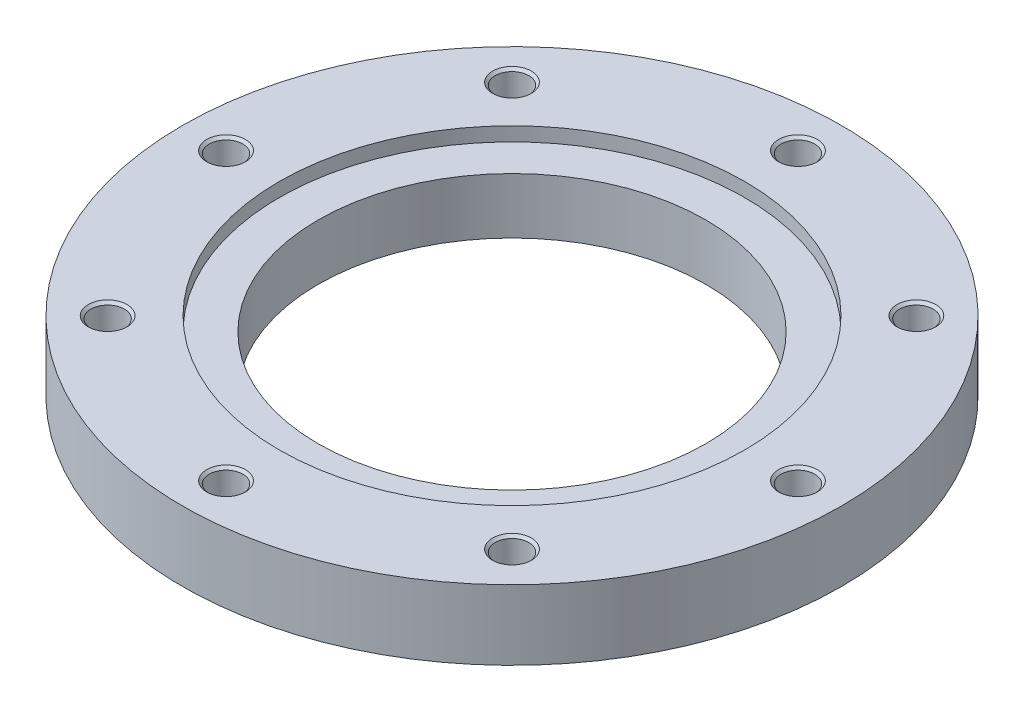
ISO-10303-21;
HEADER;
FILE_DESCRIPTION(('STEP AP214'),'2;1');
FILE_NAME('part.step','',(''),(''),'','','');
FILE_SCHEMA(('AUTOMOTIVE_DESIGN { 1 0 10303 214 1 1 1 1 }'));
ENDSEC;
DATA;
#1=APPLICATION_CONTEXT('core data for automotive mechanical design processes');
#2=APPLICATION_PROTOCOL_DEFINITION('international standard','automotive_design',2000,#1);
#3=PRODUCT_CONTEXT('',#1,'mechanical');
#4=PRODUCT('Part','Part','',(#3));
#5=PRODUCT_RELATED_PRODUCT_CATEGORY('part','',(#4));
#6=PRODUCT_DEFINITION_FORMATION('','',#4);
#7=PRODUCT_DEFINITION_CONTEXT('part definition',#1,'design');
#8=PRODUCT_DEFINITION('design','',#6,#7);
#9=PRODUCT_DEFINITION_SHAPE('','',#8);
#10=(LENGTH_UNIT() NAMED_UNIT(*) SI_UNIT(.MILLI.,.METRE.));
#11=(NAMED_UNIT(*) PLANE_ANGLE_UNIT() SI_UNIT($,.RADIAN.));
#12=(NAMED_UNIT(*) SI_UNIT($,.STERADIAN.) SOLID_ANGLE_UNIT());
#13=UNCERTAINTY_MEASURE_WITH_UNIT(LENGTH_MEASURE(1.E-05),#10,'distance_accuracy_value','');
#14=(GEOMETRIC_REPRESENTATION_CONTEXT(3) GLOBAL_UNCERTAINTY_ASSIGNED_CONTEXT((#13)) GLOBAL_UNIT_ASSIGNED_CONTEXT((#10,
#11,#12)) REPRESENTATION_CONTEXT('',''));
#15=CARTESIAN_POINT('',(0.,0.,0.));
#16=DIRECTION('',(0.,0.,1.));
#17=DIRECTION('',(1.,0.,0.));
#18=AXIS2_PLACEMENT_3D('',#15,#16,#17);
#19=CARTESIAN_POINT('',(0.,18.,0.));
#20=DIRECTION('',(0.,-1.,0.));
#21=DIRECTION('',(1.,0.,0.));
#22=AXIS2_PLACEMENT_3D('',#19,#20,#21);
#23=CYLINDRICAL_SURFACE('',#22,170.);
#24=CARTESIAN_POINT('',(0.,0.,0.));
#25=DIRECTION('',(0.,1.,0.));
#26=DIRECTION('',(1.,0.,0.));
#27=AXIS2_PLACEMENT_3D('',#24,#25,#26);
#28=CIRCLE('',#27,170.);
#29=CARTESIAN_POINT('',(170.,0.,0.));
#30=VERTEX_POINT('',#29);
#31=EDGE_CURVE('E9',#30,#30,#28,.T.);
#32=ORIENTED_EDGE('',*,*,#31,.T.);
#33=EDGE_LOOP('',(#32));
#34=FACE_BOUND('',#33,.T.);
#35=CARTESIAN_POINT('',(0.,36.,0.));
#36=DIRECTION('',(0.,1.,0.));
#37=DIRECTION('',(1.,0.,0.));
#38=AXIS2_PLACEMENT_3D('',#35,#36,#37);
#39=CIRCLE('',#38,170.);
#40=CARTESIAN_POINT('',(170.,36.,0.));
#41=VERTEX_POINT('',#40);
#42=EDGE_CURVE('E237',#41,#41,#39,.T.);
#43=ORIENTED_EDGE('',*,*,#42,.F.);
#44=EDGE_LOOP('',(#43));
#45=FACE_BOUND('',#44,.T.);
#46=ADVANCED_FACE('F15',(#34,#45),#23,.T.);
#47=CARTESIAN_POINT('',(135.,0.,0.));
#48=DIRECTION('',(0.,-1.,0.));
#49=DIRECTION('',(-1.,0.,0.));
#50=AXIS2_PLACEMENT_3D('',#47,#48,#49);
#51=PLANE('',#50);
#52=CARTESIAN_POINT('',(0.,0.,0.));
#53=DIRECTION('',(0.,1.,0.));
#54=DIRECTION('',(1.,0.,0.));
#55=AXIS2_PLACEMENT_3D('',#52,#53,#54);
#56=CIRCLE('',#55,100.);
#57=CARTESIAN_POINT('',(100.,0.,0.));
#58=VERTEX_POINT('',#57);
#59=EDGE_CURVE('E18',#58,#58,#56,.T.);
#60=ORIENTED_EDGE('',*,*,#59,.T.);
#61=EDGE_LOOP('',(#60));
#62=FACE_BOUND('',#61,.T.);
#63=ORIENTED_EDGE('',*,*,#31,.F.);
#64=EDGE_LOOP('',(#63));
#65=FACE_BOUND('',#64,.T.);
#66=ADVANCED_FACE('F305',(#62,#65),#51,.T.);
#67=CARTESIAN_POINT('',(0.,18.,0.));
#68=DIRECTION('',(0.,-1.,0.));
#69=DIRECTION('',(1.,0.,0.));
#70=AXIS2_PLACEMENT_3D('',#67,#68,#69);
#71=CYLINDRICAL_SURFACE('',#70,100.);
#72=ORIENTED_EDGE('',*,*,#59,.F.);
#73=EDGE_LOOP('',(#72));
#74=FACE_BOUND('',#73,.T.);
#75=CARTESIAN_POINT('',(0.,28.8,0.));
#76=DIRECTION('',(0.,1.,0.));
#77=DIRECTION('',(1.,0.,0.));
#78=AXIS2_PLACEMENT_3D('',#75,#76,#77);
#79=CIRCLE('',#78,100.);
#80=CARTESIAN_POINT('',(-100.,28.8,0.));
#81=VERTEX_POINT('',#80);
#82=EDGE_CURVE('E148',#81,#81,#79,.T.);
#83=ORIENTED_EDGE('',*,*,#82,.T.);
#84=EDGE_LOOP('',(#83));
#85=FACE_BOUND('',#84,.T.);
#86=ADVANCED_FACE('F309',(#74,#85),#71,.F.);
#87=CARTESIAN_POINT('',(135.,36.,0.));
#88=DIRECTION('',(0.,1.,0.));
#89=DIRECTION('',(1.,0.,0.));
#90=AXIS2_PLACEMENT_3D('',#87,#88,#89);
#91=PLANE('',#90);
#92=ORIENTED_EDGE('',*,*,#42,.T.);
#93=EDGE_LOOP('',(#92));
#94=FACE_BOUND('',#93,.T.);
#95=CARTESIAN_POINT('',(0.,36.,0.));
#96=DIRECTION('',(0.,-1.,0.));
#97=DIRECTION('',(1.,0.,0.));
#98=AXIS2_PLACEMENT_3D('',#95,#96,#97);
#99=CIRCLE('',#98,120.);
#100=CARTESIAN_POINT('',(-120.,36.,0.));
#101=VERTEX_POINT('',#100);
#102=EDGE_CURVE('E250',#101,#101,#99,.T.);
#103=ORIENTED_EDGE('',*,*,#102,.T.);
#104=EDGE_LOOP('',(#103));
#105=FACE_BOUND('',#104,.T.);
#106=CARTESIAN_POINT('',(147.5,36.,0.));
#107=DIRECTION('',(0.,-1.,0.));
#108=DIRECTION('',(1.,0.,0.));
#109=AXIS2_PLACEMENT_3D('',#106,#107,#108);
#110=CIRCLE('',#109,10.);
#111=CARTESIAN_POINT('',(157.5,36.,0.));
#112=VERTEX_POINT('',#111);
#113=EDGE_CURVE('E241',#112,#112,#110,.T.);
#114=ORIENTED_EDGE('',*,*,#113,.T.);
#115=EDGE_LOOP('',(#114));
#116=FACE_BOUND('',#115,.T.);
#117=CARTESIAN_POINT('',(104.298250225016,36.,-104.298250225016));
#118=DIRECTION('',(0.,-1.,0.));
#119=DIRECTION('',(0.707106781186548,0.,-0.707106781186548));
#120=AXIS2_PLACEMENT_3D('',#117,#118,#119);
#121=CIRCLE('',#120,10.);
#122=CARTESIAN_POINT('',(111.369318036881,36.,-111.369318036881));
#123=VERTEX_POINT('',#122);
#124=EDGE_CURVE('E271',#123,#123,#121,.T.);
#125=ORIENTED_EDGE('',*,*,#124,.T.);
#126=EDGE_LOOP('',(#125));
#127=FACE_BOUND('',#126,.T.);
#128=CARTESIAN_POINT('',(0.,36.,-147.5));
#129=DIRECTION('',(0.,-1.,0.));
#130=DIRECTION('',(0.,0.,-1.));
#131=AXIS2_PLACEMENT_3D('',#128,#129,#130);
#132=CIRCLE('',#131,10.);
#133=CARTESIAN_POINT('',(0.,36.,-157.5));
#134=VERTEX_POINT('',#133);
#135=EDGE_CURVE('E259',#134,#134,#132,.T.);
#136=ORIENTED_EDGE('',*,*,#135,.T.);
#137=EDGE_LOOP('',(#136));
#138=FACE_BOUND('',#137,.T.);
#139=CARTESIAN_POINT('',(-104.298250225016,36.,-104.298250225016));
#140=DIRECTION('',(0.,-1.,0.));
#141=DIRECTION('',(-0.707106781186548,0.,-0.707106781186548));
#142=AXIS2_PLACEMENT_3D('',#139,#140,#141);
#143=CIRCLE('',#142,10.);
#144=CARTESIAN_POINT('',(-111.369318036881,36.,-111.369318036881));
#145=VERTEX_POINT('',#144);
#146=EDGE_CURVE('E240',#145,#145,#143,.T.);
#147=ORIENTED_EDGE('',*,*,#146,.T.);
#148=EDGE_LOOP('',(#147));
#149=FACE_BOUND('',#148,.T.);
#150=CARTESIAN_POINT('',(-147.5,36.,0.));
#151=DIRECTION('',(0.,-1.,0.));
#152=DIRECTION('',(-1.,0.,0.));
#153=AXIS2_PLACEMENT_3D('',#150,#151,#152);
#154=CIRCLE('',#153,10.);
#155=CARTESIAN_POINT('',(-157.5,36.,0.));
#156=VERTEX_POINT('',#155);
#157=EDGE_CURVE('E217',#156,#156,#154,.T.);
#158=ORIENTED_EDGE('',*,*,#157,.T.);
#159=EDGE_LOOP('',(#158));
#160=FACE_BOUND('',#159,.T.);
#161=CARTESIAN_POINT('',(-104.298250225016,36.,104.298250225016));
#162=DIRECTION('',(0.,-1.,0.));
#163=DIRECTION('',(-0.707106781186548,0.,0.707106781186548));
#164=AXIS2_PLACEMENT_3D('',#161,#162,#163);
#165=CIRCLE('',#164,10.);
#166=CARTESIAN_POINT('',(-111.369318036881,36.,111.369318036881));
#167=VERTEX_POINT('',#166);
#168=EDGE_CURVE('E852',#167,#167,#165,.T.);
#169=ORIENTED_EDGE('',*,*,#168,.T.);
#170=EDGE_LOOP('',(#169));
#171=FACE_BOUND('',#170,.T.);
#172=CARTESIAN_POINT('',(0.,36.,147.5));
#173=DIRECTION('',(0.,-1.,0.));
#174=DIRECTION('',(0.,0.,1.));
#175=AXIS2_PLACEMENT_3D('',#172,#173,#174);
#176=CIRCLE('',#175,10.);
#177=CARTESIAN_POINT('',(0.,36.,157.5));
#178=VERTEX_POINT('',#177);
#179=EDGE_CURVE('E841',#178,#178,#176,.T.);
#180=ORIENTED_EDGE('',*,*,#179,.T.);
#181=EDGE_LOOP('',(#180));
#182=FACE_BOUND('',#181,.T.);
#183=CARTESIAN_POINT('',(104.298250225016,36.,104.298250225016));
#184=DIRECTION('',(0.,-1.,0.));
#185=DIRECTION('',(0.707106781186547,0.,0.707106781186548));
#186=AXIS2_PLACEMENT_3D('',#183,#184,#185);
#187=CIRCLE('',#186,10.);
#188=CARTESIAN_POINT('',(111.369318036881,36.,111.369318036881));
#189=VERTEX_POINT('',#188);
#190=EDGE_CURVE('E832',#189,#189,#187,.T.);
#191=ORIENTED_EDGE('',*,*,#190,.T.);
#192=EDGE_LOOP('',(#191));
#193=FACE_BOUND('',#192,.T.);
#194=ADVANCED_FACE('F286',(#94,#105,#116,#127,#138,#149,#160,#171,#182,#193),#91,.T.);
#195=CARTESIAN_POINT('',(0.,28.8,0.));
#196=DIRECTION('',(0.,-1.,0.));
#197=DIRECTION('',(-1.,0.,0.));
#198=AXIS2_PLACEMENT_3D('',#195,#196,#197);
#199=PLANE('',#198);
#200=CARTESIAN_POINT('',(0.,28.8,0.));
#201=DIRECTION('',(0.,-1.,0.));
#202=DIRECTION('',(1.,0.,0.));
#203=AXIS2_PLACEMENT_3D('',#200,#201,#202);
#204=CIRCLE('',#203,120.);
#205=CARTESIAN_POINT('',(120.,28.8,0.));
#206=VERTEX_POINT('',#205);
#207=EDGE_CURVE('E153',#206,#206,#204,.T.);
#208=ORIENTED_EDGE('',*,*,#207,.F.);
#209=EDGE_LOOP('',(#208));
#210=FACE_BOUND('',#209,.T.);
#211=ORIENTED_EDGE('',*,*,#82,.F.);
#212=EDGE_LOOP('',(#211));
#213=FACE_BOUND('',#212,.T.);
#214=ADVANCED_FACE('F292',(#210,#213),#199,.F.);
#215=CARTESIAN_POINT('',(0.,34.2,0.));
#216=DIRECTION('',(0.,-1.,0.));
#217=DIRECTION('',(1.,0.,0.));
#218=AXIS2_PLACEMENT_3D('',#215,#216,#217);
#219=CYLINDRICAL_SURFACE('',#218,120.);
#220=ORIENTED_EDGE('',*,*,#207,.T.);
#221=EDGE_LOOP('',(#220));
#222=FACE_BOUND('',#221,.T.);
#223=ORIENTED_EDGE('',*,*,#102,.F.);
#224=EDGE_LOOP('',(#223));
#225=FACE_BOUND('',#224,.T.);
#226=ADVANCED_FACE('F289',(#222,#225),#219,.F.);
#227=CARTESIAN_POINT('',(147.5,5.50386219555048,0.));
#228=DIRECTION('',(0.,1.,0.));
#229=DIRECTION('',(1.,0.,0.));
#230=AXIS2_PLACEMENT_3D('',#227,#228,#229);
#231=CONICAL_SURFACE('',#230,4.3234375,1.0471975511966);
#232=CARTESIAN_POINT('',(147.5,8.,0.));
#233=DIRECTION('',(0.,-1.,0.));
#234=DIRECTION('',(1.,0.,0.));
#235=AXIS2_PLACEMENT_3D('',#232,#233,#234);
#236=CIRCLE('',#235,8.646875);
#237=CARTESIAN_POINT('',(156.146875,8.,0.));
#238=VERTEX_POINT('',#237);
#239=EDGE_CURVE('E248',#238,#238,#236,.T.);
#240=ORIENTED_EDGE('',*,*,#239,.F.);
#241=EDGE_LOOP('',(#240));
#242=FACE_BOUND('',#241,.T.);
#243=CARTESIAN_POINT('',(147.5,3.00772439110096,0.));
#244=VERTEX_POINT('',#243);
#245=VERTEX_LOOP('',#244);
#246=FACE_BOUND('',#245,.T.);
#247=ADVANCED_FACE('F291',(#242,#246),#231,.F.);
#248=CARTESIAN_POINT('',(147.5,11.3234375,0.));
#249=DIRECTION('',(0.,1.,0.));
#250=DIRECTION('',(1.,0.,0.));
#251=AXIS2_PLACEMENT_3D('',#248,#249,#250);
#252=CYLINDRICAL_SURFACE('',#251,8.646875);
#253=CARTESIAN_POINT('',(147.5,14.646875,0.));
#254=DIRECTION('',(0.,-1.,0.));
#255=DIRECTION('',(1.,0.,0.));
#256=AXIS2_PLACEMENT_3D('',#253,#254,#255);
#257=CIRCLE('',#256,8.646875);
#258=CARTESIAN_POINT('',(156.146875,14.646875,0.));
#259=VERTEX_POINT('',#258);
#260=EDGE_CURVE('E251',#259,#259,#257,.T.);
#261=ORIENTED_EDGE('',*,*,#260,.F.);
#262=EDGE_LOOP('',(#261));
#263=FACE_BOUND('',#262,.T.);
#264=ORIENTED_EDGE('',*,*,#239,.T.);
#265=EDGE_LOOP('',(#264));
#266=FACE_BOUND('',#265,.T.);
#267=ADVANCED_FACE('F299',(#263,#266),#252,.F.);
#268=CARTESIAN_POINT('',(147.5,15.3234375,0.));
#269=DIRECTION('',(0.,1.,0.));
#270=DIRECTION('',(1.,0.,0.));
#271=AXIS2_PLACEMENT_3D('',#268,#269,#270);
#272=CONICAL_SURFACE('',#271,9.3234375,0.785398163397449);
#273=CARTESIAN_POINT('',(147.5,16.,0.));
#274=DIRECTION('',(0.,-1.,0.));
#275=DIRECTION('',(1.,0.,0.));
#276=AXIS2_PLACEMENT_3D('',#273,#274,#275);
#277=CIRCLE('',#276,10.);
#278=CARTESIAN_POINT('',(157.5,16.,0.));
#279=VERTEX_POINT('',#278);
#280=EDGE_CURVE('E281',#279,#279,#277,.T.);
#281=ORIENTED_EDGE('',*,*,#280,.F.);
#282=EDGE_LOOP('',(#281));
#283=FACE_BOUND('',#282,.T.);
#284=ORIENTED_EDGE('',*,*,#260,.T.);
#285=EDGE_LOOP('',(#284));
#286=FACE_BOUND('',#285,.T.);
#287=ADVANCED_FACE('F367',(#283,#286),#272,.F.);
#288=CARTESIAN_POINT('',(156.8234375,16.,0.));
#289=DIRECTION('',(0.,1.,0.));
#290=DIRECTION('',(-1.,0.,0.));
#291=AXIS2_PLACEMENT_3D('',#288,#289,#290);
#292=PLANE('',#291);
#293=CARTESIAN_POINT('',(147.5,16.,0.));
#294=DIRECTION('',(0.,-1.,0.));
#295=DIRECTION('',(1.,0.,0.));
#296=AXIS2_PLACEMENT_3D('',#293,#294,#295);
#297=CIRCLE('',#296,8.646875);
#298=CARTESIAN_POINT('',(156.146875,16.,0.));
#299=VERTEX_POINT('',#298);
#300=EDGE_CURVE('E243',#299,#299,#297,.T.);
#301=ORIENTED_EDGE('',*,*,#300,.F.);
#302=EDGE_LOOP('',(#301));
#303=FACE_BOUND('',#302,.T.);
#304=ORIENTED_EDGE('',*,*,#280,.T.);
#305=EDGE_LOOP('',(#304));
#306=FACE_BOUND('',#305,.T.);
#307=ADVANCED_FACE('F376',(#303,#306),#292,.F.);
#308=CARTESIAN_POINT('',(147.5,25.3234375,0.));
#309=DIRECTION('',(0.,1.,0.));
#310=DIRECTION('',(1.,0.,0.));
#311=AXIS2_PLACEMENT_3D('',#308,#309,#310);
#312=CYLINDRICAL_SURFACE('',#311,8.646875);
#313=CARTESIAN_POINT('',(147.5,34.646875,0.));
#314=DIRECTION('',(0.,-1.,0.));
#315=DIRECTION('',(1.,0.,0.));
#316=AXIS2_PLACEMENT_3D('',#313,#314,#315);
#317=CIRCLE('',#316,8.646875);
#318=CARTESIAN_POINT('',(156.146875,34.646875,0.));
#319=VERTEX_POINT('',#318);
#320=EDGE_CURVE('E233',#319,#319,#317,.T.);
#321=ORIENTED_EDGE('',*,*,#320,.F.);
#322=EDGE_LOOP('',(#321));
#323=FACE_BOUND('',#322,.T.);
#324=ORIENTED_EDGE('',*,*,#300,.T.);
#325=EDGE_LOOP('',(#324));
#326=FACE_BOUND('',#325,.T.);
#327=ADVANCED_FACE('F385',(#323,#326),#312,.F.);
#328=CARTESIAN_POINT('',(147.5,35.3234375,0.));
#329=DIRECTION('',(0.,1.,0.));
#330=DIRECTION('',(1.,0.,0.));
#331=AXIS2_PLACEMENT_3D('',#328,#329,#330);
#332=CONICAL_SURFACE('',#331,9.3234375,0.785398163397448);
#333=ORIENTED_EDGE('',*,*,#113,.F.);
#334=EDGE_LOOP('',(#333));
#335=FACE_BOUND('',#334,.T.);
#336=ORIENTED_EDGE('',*,*,#320,.T.);
#337=EDGE_LOOP('',(#336));
#338=FACE_BOUND('',#337,.T.);
#339=ADVANCED_FACE('F394',(#335,#338),#332,.F.);
#340=CARTESIAN_POINT('',(104.298250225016,5.50386219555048,-104.298250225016));
#341=DIRECTION('',(0.,1.,0.));
#342=DIRECTION('',(0.707106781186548,0.,-0.707106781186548));
#343=AXIS2_PLACEMENT_3D('',#340,#341,#342);
#344=CONICAL_SURFACE('',#343,4.3234375,1.0471975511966);
#345=CARTESIAN_POINT('',(104.298250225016,8.,-104.298250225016));
#346=DIRECTION('',(0.,-1.,0.));
#347=DIRECTION('',(0.707106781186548,0.,-0.707106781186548));
#348=AXIS2_PLACEMENT_3D('',#345,#346,#347);
#349=CIRCLE('',#348,8.646875);
#350=CARTESIAN_POINT('',(110.412514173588,8.,-110.412514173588));
#351=VERTEX_POINT('',#350);
#352=EDGE_CURVE('E231',#351,#351,#349,.T.);
#353=ORIENTED_EDGE('',*,*,#352,.F.);
#354=EDGE_LOOP('',(#353));
#355=FACE_BOUND('',#354,.T.);
#356=CARTESIAN_POINT('',(104.298250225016,3.00772439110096,-104.298250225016));
#357=VERTEX_POINT('',#356);
#358=VERTEX_LOOP('',#357);
#359=FACE_BOUND('',#358,.T.);
#360=ADVANCED_FACE('F403',(#355,#359),#344,.F.);
#361=CARTESIAN_POINT('',(104.298250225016,11.3234375,-104.298250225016));
#362=DIRECTION('',(0.,1.,0.));
#363=DIRECTION('',(0.707106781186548,0.,-0.707106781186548));
#364=AXIS2_PLACEMENT_3D('',#361,#362,#363);
#365=CYLINDRICAL_SURFACE('',#364,8.646875);
#366=CARTESIAN_POINT('',(104.298250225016,14.646875,-104.298250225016));
#367=DIRECTION('',(0.,-1.,0.));
#368=DIRECTION('',(0.707106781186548,0.,-0.707106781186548));
#369=AXIS2_PLACEMENT_3D('',#366,#367,#368);
#370=CIRCLE('',#369,8.646875);
#371=CARTESIAN_POINT('',(110.412514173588,14.646875,-110.412514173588));
#372=VERTEX_POINT('',#371);
#373=EDGE_CURVE('E234',#372,#372,#370,.T.);
#374=ORIENTED_EDGE('',*,*,#373,.F.);
#375=EDGE_LOOP('',(#374));
#376=FACE_BOUND('',#375,.T.);
#377=ORIENTED_EDGE('',*,*,#352,.T.);
#378=EDGE_LOOP('',(#377));
#379=FACE_BOUND('',#378,.T.);
#380=ADVANCED_FACE('F412',(#376,#379),#365,.F.);
#381=CARTESIAN_POINT('',(104.298250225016,15.3234375,-104.298250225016));
#382=DIRECTION('',(0.,1.,0.));
#383=DIRECTION('',(0.707106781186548,0.,-0.707106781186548));
#384=AXIS2_PLACEMENT_3D('',#381,#382,#383);
#385=CONICAL_SURFACE('',#384,9.3234375,0.785398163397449);
#386=CARTESIAN_POINT('',(104.298250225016,16.,-104.298250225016));
#387=DIRECTION('',(0.,-1.,0.));
#388=DIRECTION('',(0.707106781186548,0.,-0.707106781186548));
#389=AXIS2_PLACEMENT_3D('',#386,#387,#388);
#390=CIRCLE('',#389,10.);
#391=CARTESIAN_POINT('',(111.369318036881,16.,-111.369318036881));
#392=VERTEX_POINT('',#391);
#393=EDGE_CURVE('E276',#392,#392,#390,.T.);
#394=ORIENTED_EDGE('',*,*,#393,.F.);
#395=EDGE_LOOP('',(#394));
#396=FACE_BOUND('',#395,.T.);
#397=ORIENTED_EDGE('',*,*,#373,.T.);
#398=EDGE_LOOP('',(#397));
#399=FACE_BOUND('',#398,.T.);
#400=ADVANCED_FACE('F421',(#396,#399),#385,.F.);
#401=CARTESIAN_POINT('',(110.890916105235,16.,-110.890916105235));
#402=DIRECTION('',(0.,1.,0.));
#403=DIRECTION('',(-0.707106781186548,0.,0.707106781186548));
#404=AXIS2_PLACEMENT_3D('',#401,#402,#403);
#405=PLANE('',#404);
#406=CARTESIAN_POINT('',(104.298250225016,16.,-104.298250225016));
#407=DIRECTION('',(0.,-1.,0.));
#408=DIRECTION('',(0.707106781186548,0.,-0.707106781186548));
#409=AXIS2_PLACEMENT_3D('',#406,#407,#408);
#410=CIRCLE('',#409,8.646875);
#411=CARTESIAN_POINT('',(110.412514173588,16.,-110.412514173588));
#412=VERTEX_POINT('',#411);
#413=EDGE_CURVE('E274',#412,#412,#410,.T.);
#414=ORIENTED_EDGE('',*,*,#413,.F.);
#415=EDGE_LOOP('',(#414));
#416=FACE_BOUND('',#415,.T.);
#417=ORIENTED_EDGE('',*,*,#393,.T.);
#418=EDGE_LOOP('',(#417));
#419=FACE_BOUND('',#418,.T.);
#420=ADVANCED_FACE('F430',(#416,#419),#405,.F.);
#421=CARTESIAN_POINT('',(104.298250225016,25.3234375,-104.298250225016));
#422=DIRECTION('',(0.,1.,0.));
#423=DIRECTION('',(0.707106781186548,0.,-0.707106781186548));
#424=AXIS2_PLACEMENT_3D('',#421,#422,#423);
#425=CYLINDRICAL_SURFACE('',#424,8.646875);
#426=CARTESIAN_POINT('',(104.298250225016,34.646875,-104.298250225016));
#427=DIRECTION('',(0.,-1.,0.));
#428=DIRECTION('',(0.707106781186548,0.,-0.707106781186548));
#429=AXIS2_PLACEMENT_3D('',#426,#427,#428);
#430=CIRCLE('',#429,8.646875);
#431=CARTESIAN_POINT('',(110.412514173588,34.646875,-110.412514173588));
#432=VERTEX_POINT('',#431);
#433=EDGE_CURVE('E270',#432,#432,#430,.T.);
#434=ORIENTED_EDGE('',*,*,#433,.F.);
#435=EDGE_LOOP('',(#434));
#436=FACE_BOUND('',#435,.T.);
#437=ORIENTED_EDGE('',*,*,#413,.T.);
#438=EDGE_LOOP('',(#437));
#439=FACE_BOUND('',#438,.T.);
#440=ADVANCED_FACE('F439',(#436,#439),#425,.F.);
#441=CARTESIAN_POINT('',(104.298250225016,35.3234375,-104.298250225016));
#442=DIRECTION('',(0.,1.,0.));
#443=DIRECTION('',(0.707106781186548,0.,-0.707106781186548));
#444=AXIS2_PLACEMENT_3D('',#441,#442,#443);
#445=CONICAL_SURFACE('',#444,9.3234375,0.785398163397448);
#446=ORIENTED_EDGE('',*,*,#124,.F.);
#447=EDGE_LOOP('',(#446));
#448=FACE_BOUND('',#447,.T.);
#449=ORIENTED_EDGE('',*,*,#433,.T.);
#450=EDGE_LOOP('',(#449));
#451=FACE_BOUND('',#450,.T.);
#452=ADVANCED_FACE('F448',(#448,#451),#445,.F.);
#453=CARTESIAN_POINT('',(0.,5.50386219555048,-147.5));
#454=DIRECTION('',(0.,1.,0.));
#455=DIRECTION('',(0.,0.,-1.));
#456=AXIS2_PLACEMENT_3D('',#453,#454,#455);
#457=CONICAL_SURFACE('',#456,4.3234375,1.0471975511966);
#458=CARTESIAN_POINT('',(0.,8.,-147.5));
#459=DIRECTION('',(0.,-1.,0.));
#460=DIRECTION('',(0.,0.,-1.));
#461=AXIS2_PLACEMENT_3D('',#458,#459,#460);
#462=CIRCLE('',#461,8.646875);
#463=CARTESIAN_POINT('',(0.,8.,-156.146875));
#464=VERTEX_POINT('',#463);
#465=EDGE_CURVE('E268',#464,#464,#462,.T.);
#466=ORIENTED_EDGE('',*,*,#465,.F.);
#467=EDGE_LOOP('',(#466));
#468=FACE_BOUND('',#467,.T.);
#469=CARTESIAN_POINT('',(0.,3.00772439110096,-147.5));
#470=VERTEX_POINT('',#469);
#471=VERTEX_LOOP('',#470);
#472=FACE_BOUND('',#471,.T.);
#473=ADVANCED_FACE('F457',(#468,#472),#457,.F.);
#474=CARTESIAN_POINT('',(0.,11.3234375,-147.5));
#475=DIRECTION('',(0.,1.,0.));
#476=DIRECTION('',(0.,0.,-1.));
#477=AXIS2_PLACEMENT_3D('',#474,#475,#476);
#478=CYLINDRICAL_SURFACE('',#477,8.646875);
#479=CARTESIAN_POINT('',(0.,14.646875,-147.5));
#480=DIRECTION('',(0.,-1.,0.));
#481=DIRECTION('',(0.,0.,-1.));
#482=AXIS2_PLACEMENT_3D('',#479,#480,#481);
#483=CIRCLE('',#482,8.646875);
#484=CARTESIAN_POINT('',(0.,14.646875,-156.146875));
#485=VERTEX_POINT('',#484);
#486=EDGE_CURVE('E266',#485,#485,#483,.T.);
#487=ORIENTED_EDGE('',*,*,#486,.F.);
#488=EDGE_LOOP('',(#487));
#489=FACE_BOUND('',#488,.T.);
#490=ORIENTED_EDGE('',*,*,#465,.T.);
#491=EDGE_LOOP('',(#490));
#492=FACE_BOUND('',#491,.T.);
#493=ADVANCED_FACE('F466',(#489,#492),#478,.F.);
#494=CARTESIAN_POINT('',(0.,15.3234375,-147.5));
#495=DIRECTION('',(0.,1.,0.));
#496=DIRECTION('',(0.,0.,-1.));
#497=AXIS2_PLACEMENT_3D('',#494,#495,#496);
#498=CONICAL_SURFACE('',#497,9.3234375,0.785398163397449);
#499=CARTESIAN_POINT('',(0.,16.,-147.5));
#500=DIRECTION('',(0.,-1.,0.));
#501=DIRECTION('',(0.,0.,-1.));
#502=AXIS2_PLACEMENT_3D('',#499,#500,#501);
#503=CIRCLE('',#502,10.);
#504=CARTESIAN_POINT('',(0.,16.,-157.5));
#505=VERTEX_POINT('',#504);
#506=EDGE_CURVE('E264',#505,#505,#503,.T.);
#507=ORIENTED_EDGE('',*,*,#506,.F.);
#508=EDGE_LOOP('',(#507));
#509=FACE_BOUND('',#508,.T.);
#510=ORIENTED_EDGE('',*,*,#486,.T.);
#511=EDGE_LOOP('',(#510));
#512=FACE_BOUND('',#511,.T.);
#513=ADVANCED_FACE('F475',(#509,#512),#498,.F.);
#514=CARTESIAN_POINT('',(0.,16.,-156.8234375));
#515=DIRECTION('',(0.,1.,0.));
#516=DIRECTION('',(0.,0.,1.));
#517=AXIS2_PLACEMENT_3D('',#514,#515,#516);
#518=PLANE('',#517);
#519=CARTESIAN_POINT('',(0.,16.,-147.5));
#520=DIRECTION('',(0.,-1.,0.));
#521=DIRECTION('',(0.,0.,-1.));
#522=AXIS2_PLACEMENT_3D('',#519,#520,#521);
#523=CIRCLE('',#522,8.646875);
#524=CARTESIAN_POINT('',(0.,16.,-156.146875));
#525=VERTEX_POINT('',#524);
#526=EDGE_CURVE('E262',#525,#525,#523,.T.);
#527=ORIENTED_EDGE('',*,*,#526,.F.);
#528=EDGE_LOOP('',(#527));
#529=FACE_BOUND('',#528,.T.);
#530=ORIENTED_EDGE('',*,*,#506,.T.);
#531=EDGE_LOOP('',(#530));
#532=FACE_BOUND('',#531,.T.);
#533=ADVANCED_FACE('F484',(#529,#532),#518,.F.);
#534=CARTESIAN_POINT('',(0.,25.3234375,-147.5));
#535=DIRECTION('',(0.,1.,0.));
#536=DIRECTION('',(0.,0.,-1.));
#537=AXIS2_PLACEMENT_3D('',#534,#535,#536);
#538=CYLINDRICAL_SURFACE('',#537,8.646875);
#539=CARTESIAN_POINT('',(0.,34.646875,-147.5));
#540=DIRECTION('',(0.,-1.,0.));
#541=DIRECTION('',(0.,0.,-1.));
#542=AXIS2_PLACEMENT_3D('',#539,#540,#541);
#543=CIRCLE('',#542,8.646875);
#544=CARTESIAN_POINT('',(0.,34.646875,-156.146875));
#545=VERTEX_POINT('',#544);
#546=EDGE_CURVE('E257',#545,#545,#543,.T.);
#547=ORIENTED_EDGE('',*,*,#546,.F.);
#548=EDGE_LOOP('',(#547));
#549=FACE_BOUND('',#548,.T.);
#550=ORIENTED_EDGE('',*,*,#526,.T.);
#551=EDGE_LOOP('',(#550));
#552=FACE_BOUND('',#551,.T.);
#553=ADVANCED_FACE('F493',(#549,#552),#538,.F.);
#554=CARTESIAN_POINT('',(0.,35.3234375,-147.5));
#555=DIRECTION('',(0.,1.,0.));
#556=DIRECTION('',(0.,0.,-1.));
#557=AXIS2_PLACEMENT_3D('',#554,#555,#556);
#558=CONICAL_SURFACE('',#557,9.3234375,0.785398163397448);
#559=ORIENTED_EDGE('',*,*,#135,.F.);
#560=EDGE_LOOP('',(#559));
#561=FACE_BOUND('',#560,.T.);
#562=ORIENTED_EDGE('',*,*,#546,.T.);
#563=EDGE_LOOP('',(#562));
#564=FACE_BOUND('',#563,.T.);
#565=ADVANCED_FACE('F502',(#561,#564),#558,.F.);
#566=CARTESIAN_POINT('',(-104.298250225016,5.50386219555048,-104.298250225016));
#567=DIRECTION('',(0.,1.,0.));
#568=DIRECTION('',(-0.707106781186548,0.,-0.707106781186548));
#569=AXIS2_PLACEMENT_3D('',#566,#567,#568);
#570=CONICAL_SURFACE('',#569,4.3234375,1.0471975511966);
#571=CARTESIAN_POINT('',(-104.298250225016,8.,-104.298250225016));
#572=DIRECTION('',(0.,-1.,0.));
#573=DIRECTION('',(-0.707106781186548,0.,-0.707106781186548));
#574=AXIS2_PLACEMENT_3D('',#571,#572,#573);
#575=CIRCLE('',#574,8.646875);
#576=CARTESIAN_POINT('',(-110.412514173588,8.,-110.412514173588));
#577=VERTEX_POINT('',#576);
#578=EDGE_CURVE('E255',#577,#577,#575,.T.);
#579=ORIENTED_EDGE('',*,*,#578,.F.);
#580=EDGE_LOOP('',(#579));
#581=FACE_BOUND('',#580,.T.);
#582=CARTESIAN_POINT('',(-104.298250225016,3.00772439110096,-104.298250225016));
#583=VERTEX_POINT('',#582);
#584=VERTEX_LOOP('',#583);
#585=FACE_BOUND('',#584,.T.);
#586=ADVANCED_FACE('F511',(#581,#585),#570,.F.);
#587=CARTESIAN_POINT('',(-104.298250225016,11.3234375,-104.298250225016));
#588=DIRECTION('',(0.,1.,0.));
#589=DIRECTION('',(-0.707106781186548,0.,-0.707106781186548));
#590=AXIS2_PLACEMENT_3D('',#587,#588,#589);
#591=CYLINDRICAL_SURFACE('',#590,8.646875);
#592=CARTESIAN_POINT('',(-104.298250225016,14.646875,-104.298250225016));
#593=DIRECTION('',(0.,-1.,0.));
#594=DIRECTION('',(-0.707106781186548,0.,-0.707106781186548));
#595=AXIS2_PLACEMENT_3D('',#592,#593,#594);
#596=CIRCLE('',#595,8.646875);
#597=CARTESIAN_POINT('',(-110.412514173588,14.646875,-110.412514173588));
#598=VERTEX_POINT('',#597);
#599=EDGE_CURVE('E253',#598,#598,#596,.T.);
#600=ORIENTED_EDGE('',*,*,#599,.F.);
#601=EDGE_LOOP('',(#600));
#602=FACE_BOUND('',#601,.T.);
#603=ORIENTED_EDGE('',*,*,#578,.T.);
#604=EDGE_LOOP('',(#603));
#605=FACE_BOUND('',#604,.T.);
#606=ADVANCED_FACE('F520',(#602,#605),#591,.F.);
#607=CARTESIAN_POINT('',(-104.298250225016,15.3234375,-104.298250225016));
#608=DIRECTION('',(0.,1.,0.));
#609=DIRECTION('',(-0.707106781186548,0.,-0.707106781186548));
#610=AXIS2_PLACEMENT_3D('',#607,#608,#609);
#611=CONICAL_SURFACE('',#610,9.3234375,0.785398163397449);
#612=CARTESIAN_POINT('',(-104.298250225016,16.,-104.298250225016));
#613=DIRECTION('',(0.,-1.,0.));
#614=DIRECTION('',(-0.707106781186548,0.,-0.707106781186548));
#615=AXIS2_PLACEMENT_3D('',#612,#613,#614);
#616=CIRCLE('',#615,10.);
#617=CARTESIAN_POINT('',(-111.369318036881,16.,-111.369318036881));
#618=VERTEX_POINT('',#617);
#619=EDGE_CURVE('E247',#618,#618,#616,.T.);
#620=ORIENTED_EDGE('',*,*,#619,.F.);
#621=EDGE_LOOP('',(#620));
#622=FACE_BOUND('',#621,.T.);
#623=ORIENTED_EDGE('',*,*,#599,.T.);
#624=EDGE_LOOP('',(#623));
#625=FACE_BOUND('',#624,.T.);
#626=ADVANCED_FACE('F529',(#622,#625),#611,.F.);
#627=CARTESIAN_POINT('',(-110.890916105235,16.,-110.890916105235));
#628=DIRECTION('',(0.,1.,0.));
#629=DIRECTION('',(0.707106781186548,0.,0.707106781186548));
#630=AXIS2_PLACEMENT_3D('',#627,#628,#629);
#631=PLANE('',#630);
#632=CARTESIAN_POINT('',(-104.298250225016,16.,-104.298250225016));
#633=DIRECTION('',(0.,-1.,0.));
#634=DIRECTION('',(-0.707106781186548,0.,-0.707106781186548));
#635=AXIS2_PLACEMENT_3D('',#632,#633,#634);
#636=CIRCLE('',#635,8.646875);
#637=CARTESIAN_POINT('',(-110.412514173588,16.,-110.412514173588));
#638=VERTEX_POINT('',#637);
#639=EDGE_CURVE('E245',#638,#638,#636,.T.);
#640=ORIENTED_EDGE('',*,*,#639,.F.);
#641=EDGE_LOOP('',(#640));
#642=FACE_BOUND('',#641,.T.);
#643=ORIENTED_EDGE('',*,*,#619,.T.);
#644=EDGE_LOOP('',(#643));
#645=FACE_BOUND('',#644,.T.);
#646=ADVANCED_FACE('F538',(#642,#645),#631,.F.);
#647=CARTESIAN_POINT('',(-104.298250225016,25.3234375,-104.298250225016));
#648=DIRECTION('',(0.,1.,0.));
#649=DIRECTION('',(-0.707106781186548,0.,-0.707106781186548));
#650=AXIS2_PLACEMENT_3D('',#647,#648,#649);
#651=CYLINDRICAL_SURFACE('',#650,8.646875);
#652=CARTESIAN_POINT('',(-104.298250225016,34.646875,-104.298250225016));
#653=DIRECTION('',(0.,-1.,0.));
#654=DIRECTION('',(-0.707106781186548,0.,-0.707106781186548));
#655=AXIS2_PLACEMENT_3D('',#652,#653,#654);
#656=CIRCLE('',#655,8.646875);
#657=CARTESIAN_POINT('',(-110.412514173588,34.646875,-110.412514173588));
#658=VERTEX_POINT('',#657);
#659=EDGE_CURVE('E236',#658,#658,#656,.T.);
#660=ORIENTED_EDGE('',*,*,#659,.F.);
#661=EDGE_LOOP('',(#660));
#662=FACE_BOUND('',#661,.T.);
#663=ORIENTED_EDGE('',*,*,#639,.T.);
#664=EDGE_LOOP('',(#663));
#665=FACE_BOUND('',#664,.T.);
#666=ADVANCED_FACE('F547',(#662,#665),#651,.F.);
#667=CARTESIAN_POINT('',(-104.298250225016,35.3234375,-104.298250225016));
#668=DIRECTION('',(0.,1.,0.));
#669=DIRECTION('',(-0.707106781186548,0.,-0.707106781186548));
#670=AXIS2_PLACEMENT_3D('',#667,#668,#669);
#671=CONICAL_SURFACE('',#670,9.3234375,0.785398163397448);
#672=ORIENTED_EDGE('',*,*,#146,.F.);
#673=EDGE_LOOP('',(#672));
#674=FACE_BOUND('',#673,.T.);
#675=ORIENTED_EDGE('',*,*,#659,.T.);
#676=EDGE_LOOP('',(#675));
#677=FACE_BOUND('',#676,.T.);
#678=ADVANCED_FACE('F556',(#674,#677),#671,.F.);
#679=CARTESIAN_POINT('',(-147.5,5.50386219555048,0.));
#680=DIRECTION('',(0.,1.,0.));
#681=DIRECTION('',(-1.,0.,0.));
#682=AXIS2_PLACEMENT_3D('',#679,#680,#681);
#683=CONICAL_SURFACE('',#682,4.3234375,1.0471975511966);
#684=CARTESIAN_POINT('',(-147.5,8.,0.));
#685=DIRECTION('',(0.,-1.,0.));
#686=DIRECTION('',(-1.,0.,0.));
#687=AXIS2_PLACEMENT_3D('',#684,#685,#686);
#688=CIRCLE('',#687,8.646875);
#689=CARTESIAN_POINT('',(-156.146875,8.,0.));
#690=VERTEX_POINT('',#689);
#691=EDGE_CURVE('E230',#690,#690,#688,.T.);
#692=ORIENTED_EDGE('',*,*,#691,.F.);
#693=EDGE_LOOP('',(#692));
#694=FACE_BOUND('',#693,.T.);
#695=CARTESIAN_POINT('',(-147.5,3.00772439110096,0.));
#696=VERTEX_POINT('',#695);
#697=VERTEX_LOOP('',#696);
#698=FACE_BOUND('',#697,.T.);
#699=ADVANCED_FACE('F565',(#694,#698),#683,.F.);
#700=CARTESIAN_POINT('',(-147.5,11.3234375,0.));
#701=DIRECTION('',(0.,1.,0.));
#702=DIRECTION('',(-1.,0.,0.));
#703=AXIS2_PLACEMENT_3D('',#700,#701,#702);
#704=CYLINDRICAL_SURFACE('',#703,8.646875);
#705=CARTESIAN_POINT('',(-147.5,14.646875,0.));
#706=DIRECTION('',(0.,-1.,0.));
#707=DIRECTION('',(-1.,0.,0.));
#708=AXIS2_PLACEMENT_3D('',#705,#706,#707);
#709=CIRCLE('',#708,8.646875);
#710=CARTESIAN_POINT('',(-156.146875,14.646875,0.));
#711=VERTEX_POINT('',#710);
#712=EDGE_CURVE('E228',#711,#711,#709,.T.);
#713=ORIENTED_EDGE('',*,*,#712,.F.);
#714=EDGE_LOOP('',(#713));
#715=FACE_BOUND('',#714,.T.);
#716=ORIENTED_EDGE('',*,*,#691,.T.);
#717=EDGE_LOOP('',(#716));
#718=FACE_BOUND('',#717,.T.);
#719=ADVANCED_FACE('F574',(#715,#718),#704,.F.);
#720=CARTESIAN_POINT('',(-147.5,15.3234375,0.));
#721=DIRECTION('',(0.,1.,0.));
#722=DIRECTION('',(-1.,0.,0.));
#723=AXIS2_PLACEMENT_3D('',#720,#721,#722);
#724=CONICAL_SURFACE('',#723,9.3234375,0.785398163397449);
#725=CARTESIAN_POINT('',(-147.5,16.,0.));
#726=DIRECTION('',(0.,-1.,0.));
#727=DIRECTION('',(-1.,0.,0.));
#728=AXIS2_PLACEMENT_3D('',#725,#726,#727);
#729=CIRCLE('',#728,10.);
#730=CARTESIAN_POINT('',(-157.5,16.,0.));
#731=VERTEX_POINT('',#730);
#732=EDGE_CURVE('E226',#731,#731,#729,.T.);
#733=ORIENTED_EDGE('',*,*,#732,.F.);
#734=EDGE_LOOP('',(#733));
#735=FACE_BOUND('',#734,.T.);
#736=ORIENTED_EDGE('',*,*,#712,.T.);
#737=EDGE_LOOP('',(#736));
#738=FACE_BOUND('',#737,.T.);
#739=ADVANCED_FACE('F583',(#735,#738),#724,.F.);
#740=CARTESIAN_POINT('',(-156.8234375,16.,0.));
#741=DIRECTION('',(0.,1.,0.));
#742=DIRECTION('',(1.,0.,0.));
#743=AXIS2_PLACEMENT_3D('',#740,#741,#742);
#744=PLANE('',#743);
#745=CARTESIAN_POINT('',(-147.5,16.,0.));
#746=DIRECTION('',(0.,-1.,0.));
#747=DIRECTION('',(-1.,0.,0.));
#748=AXIS2_PLACEMENT_3D('',#745,#746,#747);
#749=CIRCLE('',#748,8.646875);
#750=CARTESIAN_POINT('',(-156.146875,16.,0.));
#751=VERTEX_POINT('',#750);
#752=EDGE_CURVE('E224',#751,#751,#749,.T.);
#753=ORIENTED_EDGE('',*,*,#752,.F.);
#754=EDGE_LOOP('',(#753));
#755=FACE_BOUND('',#754,.T.);
#756=ORIENTED_EDGE('',*,*,#732,.T.);
#757=EDGE_LOOP('',(#756));
#758=FACE_BOUND('',#757,.T.);
#759=ADVANCED_FACE('F592',(#755,#758),#744,.F.);
#760=CARTESIAN_POINT('',(-147.5,25.3234375,0.));
#761=DIRECTION('',(0.,1.,0.));
#762=DIRECTION('',(-1.,0.,0.));
#763=AXIS2_PLACEMENT_3D('',#760,#761,#762);
#764=CYLINDRICAL_SURFACE('',#763,8.646875);
#765=CARTESIAN_POINT('',(-147.5,34.646875,0.));
#766=DIRECTION('',(0.,-1.,0.));
#767=DIRECTION('',(-1.,0.,0.));
#768=AXIS2_PLACEMENT_3D('',#765,#766,#767);
#769=CIRCLE('',#768,8.646875);
#770=CARTESIAN_POINT('',(-156.146875,34.646875,0.));
#771=VERTEX_POINT('',#770);
#772=EDGE_CURVE('E214',#771,#771,#769,.T.);
#773=ORIENTED_EDGE('',*,*,#772,.F.);
#774=EDGE_LOOP('',(#773));
#775=FACE_BOUND('',#774,.T.);
#776=ORIENTED_EDGE('',*,*,#752,.T.);
#777=EDGE_LOOP('',(#776));
#778=FACE_BOUND('',#777,.T.);
#779=ADVANCED_FACE('F601',(#775,#778),#764,.F.);
#780=CARTESIAN_POINT('',(-147.5,35.3234375,0.));
#781=DIRECTION('',(0.,1.,0.));
#782=DIRECTION('',(-1.,0.,0.));
#783=AXIS2_PLACEMENT_3D('',#780,#781,#782);
#784=CONICAL_SURFACE('',#783,9.3234375,0.785398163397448);
#785=ORIENTED_EDGE('',*,*,#157,.F.);
#786=EDGE_LOOP('',(#785));
#787=FACE_BOUND('',#786,.T.);
#788=ORIENTED_EDGE('',*,*,#772,.T.);
#789=EDGE_LOOP('',(#788));
#790=FACE_BOUND('',#789,.T.);
#791=ADVANCED_FACE('F610',(#787,#790),#784,.F.);
#792=CARTESIAN_POINT('',(-104.298250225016,5.50386219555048,104.298250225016));
#793=DIRECTION('',(0.,1.,0.));
#794=DIRECTION('',(-0.707106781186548,0.,0.707106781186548));
#795=AXIS2_PLACEMENT_3D('',#792,#793,#794);
#796=CONICAL_SURFACE('',#795,4.3234375,1.0471975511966);
#797=CARTESIAN_POINT('',(-104.298250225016,8.,104.298250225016));
#798=DIRECTION('',(0.,-1.,0.));
#799=DIRECTION('',(-0.707106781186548,0.,0.707106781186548));
#800=AXIS2_PLACEMENT_3D('',#797,#798,#799);
#801=CIRCLE('',#800,8.646875);
#802=CARTESIAN_POINT('',(-110.412514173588,8.,110.412514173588));
#803=VERTEX_POINT('',#802);
#804=EDGE_CURVE('E211',#803,#803,#801,.T.);
#805=ORIENTED_EDGE('',*,*,#804,.F.);
#806=EDGE_LOOP('',(#805));
#807=FACE_BOUND('',#806,.T.);
#808=CARTESIAN_POINT('',(-104.298250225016,3.00772439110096,104.298250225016));
#809=VERTEX_POINT('',#808);
#810=VERTEX_LOOP('',#809);
#811=FACE_BOUND('',#810,.T.);
#812=ADVANCED_FACE('F619',(#807,#811),#796,.F.);
#813=CARTESIAN_POINT('',(-104.298250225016,11.3234375,104.298250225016));
#814=DIRECTION('',(0.,1.,0.));
#815=DIRECTION('',(-0.707106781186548,0.,0.707106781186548));
#816=AXIS2_PLACEMENT_3D('',#813,#814,#815);
#817=CYLINDRICAL_SURFACE('',#816,8.646875);
#818=CARTESIAN_POINT('',(-104.298250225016,14.646875,104.298250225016));
#819=DIRECTION('',(0.,-1.,0.));
#820=DIRECTION('',(-0.707106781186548,0.,0.707106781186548));
#821=AXIS2_PLACEMENT_3D('',#818,#819,#820);
#822=CIRCLE('',#821,8.646875);
#823=CARTESIAN_POINT('',(-110.412514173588,14.646875,110.412514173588));
#824=VERTEX_POINT('',#823);
#825=EDGE_CURVE('E215',#824,#824,#822,.T.);
#826=ORIENTED_EDGE('',*,*,#825,.F.);
#827=EDGE_LOOP('',(#826));
#828=FACE_BOUND('',#827,.T.);
#829=ORIENTED_EDGE('',*,*,#804,.T.);
#830=EDGE_LOOP('',(#829));
#831=FACE_BOUND('',#830,.T.);
#832=ADVANCED_FACE('F212',(#828,#831),#817,.F.);
#833=CARTESIAN_POINT('',(-104.298250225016,15.3234375,104.298250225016));
#834=DIRECTION('',(0.,1.,0.));
#835=DIRECTION('',(-0.707106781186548,0.,0.707106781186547));
#836=AXIS2_PLACEMENT_3D('',#833,#834,#835);
#837=CONICAL_SURFACE('',#836,9.3234375,0.785398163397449);
#838=CARTESIAN_POINT('',(-104.298250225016,16.,104.298250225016));
#839=DIRECTION('',(0.,-1.,0.));
#840=DIRECTION('',(-0.707106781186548,0.,0.707106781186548));
#841=AXIS2_PLACEMENT_3D('',#838,#839,#840);
#842=CIRCLE('',#841,10.);
#843=CARTESIAN_POINT('',(-111.369318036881,16.,111.369318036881));
#844=VERTEX_POINT('',#843);
#845=EDGE_CURVE('E219',#844,#844,#842,.T.);
#846=ORIENTED_EDGE('',*,*,#845,.F.);
#847=EDGE_LOOP('',(#846));
#848=FACE_BOUND('',#847,.T.);
#849=ORIENTED_EDGE('',*,*,#825,.T.);
#850=EDGE_LOOP('',(#849));
#851=FACE_BOUND('',#850,.T.);
#852=ADVANCED_FACE('F635',(#848,#851),#837,.F.);
#853=CARTESIAN_POINT('',(-110.890916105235,16.,110.890916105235));
#854=DIRECTION('',(0.,1.,0.));
#855=DIRECTION('',(0.707106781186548,0.,-0.707106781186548));
#856=AXIS2_PLACEMENT_3D('',#853,#854,#855);
#857=PLANE('',#856);
#858=CARTESIAN_POINT('',(-104.298250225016,16.,104.298250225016));
#859=DIRECTION('',(0.,-1.,0.));
#860=DIRECTION('',(-0.707106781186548,0.,0.707106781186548));
#861=AXIS2_PLACEMENT_3D('',#858,#859,#860);
#862=CIRCLE('',#861,8.646875);
#863=CARTESIAN_POINT('',(-110.412514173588,16.,110.412514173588));
#864=VERTEX_POINT('',#863);
#865=EDGE_CURVE('E854',#864,#864,#862,.T.);
#866=ORIENTED_EDGE('',*,*,#865,.F.);
#867=EDGE_LOOP('',(#866));
#868=FACE_BOUND('',#867,.T.);
#869=ORIENTED_EDGE('',*,*,#845,.T.);
#870=EDGE_LOOP('',(#869));
#871=FACE_BOUND('',#870,.T.);
#872=ADVANCED_FACE('F644',(#868,#871),#857,.F.);
#873=CARTESIAN_POINT('',(-104.298250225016,25.3234375,104.298250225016));
#874=DIRECTION('',(0.,1.,0.));
#875=DIRECTION('',(-0.707106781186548,0.,0.707106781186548));
#876=AXIS2_PLACEMENT_3D('',#873,#874,#875);
#877=CYLINDRICAL_SURFACE('',#876,8.646875);
#878=CARTESIAN_POINT('',(-104.298250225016,34.646875,104.298250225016));
#879=DIRECTION('',(0.,-1.,0.));
#880=DIRECTION('',(-0.707106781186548,0.,0.707106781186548));
#881=AXIS2_PLACEMENT_3D('',#878,#879,#880);
#882=CIRCLE('',#881,8.646875);
#883=CARTESIAN_POINT('',(-110.412514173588,34.646875,110.412514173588));
#884=VERTEX_POINT('',#883);
#885=EDGE_CURVE('E855',#884,#884,#882,.T.);
#886=ORIENTED_EDGE('',*,*,#885,.F.);
#887=EDGE_LOOP('',(#886));
#888=FACE_BOUND('',#887,.T.);
#889=ORIENTED_EDGE('',*,*,#865,.T.);
#890=EDGE_LOOP('',(#889));
#891=FACE_BOUND('',#890,.T.);
#892=ADVANCED_FACE('F653',(#888,#891),#877,.F.);
#893=CARTESIAN_POINT('',(-104.298250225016,35.3234375,104.298250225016));
#894=DIRECTION('',(0.,1.,0.));
#895=DIRECTION('',(-0.707106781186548,0.,0.707106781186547));
#896=AXIS2_PLACEMENT_3D('',#893,#894,#895);
#897=CONICAL_SURFACE('',#896,9.3234375,0.785398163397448);
#898=ORIENTED_EDGE('',*,*,#168,.F.);
#899=EDGE_LOOP('',(#898));
#900=FACE_BOUND('',#899,.T.);
#901=ORIENTED_EDGE('',*,*,#885,.T.);
#902=EDGE_LOOP('',(#901));
#903=FACE_BOUND('',#902,.T.);
#904=ADVANCED_FACE('F662',(#900,#903),#897,.F.);
#905=CARTESIAN_POINT('',(0.,5.50386219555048,147.5));
#906=DIRECTION('',(0.,1.,0.));
#907=DIRECTION('',(0.,0.,1.));
#908=AXIS2_PLACEMENT_3D('',#905,#906,#907);
#909=CONICAL_SURFACE('',#908,4.3234375,1.0471975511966);
#910=CARTESIAN_POINT('',(0.,8.,147.5));
#911=DIRECTION('',(0.,-1.,0.));
#912=DIRECTION('',(0.,0.,1.));
#913=AXIS2_PLACEMENT_3D('',#910,#911,#912);
#914=CIRCLE('',#913,8.646875);
#915=CARTESIAN_POINT('',(0.,8.,156.146875));
#916=VERTEX_POINT('',#915);
#917=EDGE_CURVE('E856',#916,#916,#914,.T.);
#918=ORIENTED_EDGE('',*,*,#917,.F.);
#919=EDGE_LOOP('',(#918));
#920=FACE_BOUND('',#919,.T.);
#921=CARTESIAN_POINT('',(0.,3.00772439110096,147.5));
#922=VERTEX_POINT('',#921);
#923=VERTEX_LOOP('',#922);
#924=FACE_BOUND('',#923,.T.);
#925=ADVANCED_FACE('F671',(#920,#924),#909,.F.);
#926=CARTESIAN_POINT('',(0.,11.3234375,147.5));
#927=DIRECTION('',(0.,1.,0.));
#928=DIRECTION('',(0.,0.,1.));
#929=AXIS2_PLACEMENT_3D('',#926,#927,#928);
#930=CYLINDRICAL_SURFACE('',#929,8.646875);
#931=CARTESIAN_POINT('',(0.,14.646875,147.5));
#932=DIRECTION('',(0.,-1.,0.));
#933=DIRECTION('',(0.,0.,1.));
#934=AXIS2_PLACEMENT_3D('',#931,#932,#933);
#935=CIRCLE('',#934,8.646875);
#936=CARTESIAN_POINT('',(0.,14.646875,156.146875));
#937=VERTEX_POINT('',#936);
#938=EDGE_CURVE('E858',#937,#937,#935,.T.);
#939=ORIENTED_EDGE('',*,*,#938,.F.);
#940=EDGE_LOOP('',(#939));
#941=FACE_BOUND('',#940,.T.);
#942=ORIENTED_EDGE('',*,*,#917,.T.);
#943=EDGE_LOOP('',(#942));
#944=FACE_BOUND('',#943,.T.);
#945=ADVANCED_FACE('F680',(#941,#944),#930,.F.);
#946=CARTESIAN_POINT('',(0.,15.3234375,147.5));
#947=DIRECTION('',(0.,1.,0.));
#948=DIRECTION('',(0.,0.,1.));
#949=AXIS2_PLACEMENT_3D('',#946,#947,#948);
#950=CONICAL_SURFACE('',#949,9.3234375,0.785398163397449);
#951=CARTESIAN_POINT('',(0.,16.,147.5));
#952=DIRECTION('',(0.,-1.,0.));
#953=DIRECTION('',(0.,0.,1.));
#954=AXIS2_PLACEMENT_3D('',#951,#952,#953);
#955=CIRCLE('',#954,10.);
#956=CARTESIAN_POINT('',(0.,16.,157.5));
#957=VERTEX_POINT('',#956);
#958=EDGE_CURVE('E862',#957,#957,#955,.T.);
#959=ORIENTED_EDGE('',*,*,#958,.F.);
#960=EDGE_LOOP('',(#959));
#961=FACE_BOUND('',#960,.T.);
#962=ORIENTED_EDGE('',*,*,#938,.T.);
#963=EDGE_LOOP('',(#962));
#964=FACE_BOUND('',#963,.T.);
#965=ADVANCED_FACE('F689',(#961,#964),#950,.F.);
#966=CARTESIAN_POINT('',(0.,16.,156.8234375));
#967=DIRECTION('',(0.,1.,0.));
#968=DIRECTION('',(0.,0.,-1.));
#969=AXIS2_PLACEMENT_3D('',#966,#967,#968);
#970=PLANE('',#969);
#971=CARTESIAN_POINT('',(0.,16.,147.5));
#972=DIRECTION('',(0.,-1.,0.));
#973=DIRECTION('',(0.,0.,1.));
#974=AXIS2_PLACEMENT_3D('',#971,#972,#973);
#975=CIRCLE('',#974,8.646875);
#976=CARTESIAN_POINT('',(0.,16.,156.146875));
#977=VERTEX_POINT('',#976);
#978=EDGE_CURVE('E843',#977,#977,#975,.T.);
#979=ORIENTED_EDGE('',*,*,#978,.F.);
#980=EDGE_LOOP('',(#979));
#981=FACE_BOUND('',#980,.T.);
#982=ORIENTED_EDGE('',*,*,#958,.T.);
#983=EDGE_LOOP('',(#982));
#984=FACE_BOUND('',#983,.T.);
#985=ADVANCED_FACE('F698',(#981,#984),#970,.F.);
#986=CARTESIAN_POINT('',(0.,25.3234375,147.5));
#987=DIRECTION('',(0.,1.,0.));
#988=DIRECTION('',(0.,0.,1.));
#989=AXIS2_PLACEMENT_3D('',#986,#987,#988);
#990=CYLINDRICAL_SURFACE('',#989,8.646875);
#991=CARTESIAN_POINT('',(0.,34.646875,147.5));
#992=DIRECTION('',(0.,-1.,0.));
#993=DIRECTION('',(0.,0.,1.));
#994=AXIS2_PLACEMENT_3D('',#991,#992,#993);
#995=CIRCLE('',#994,8.646875);
#996=CARTESIAN_POINT('',(0.,34.646875,156.146875));
#997=VERTEX_POINT('',#996);
#998=EDGE_CURVE('E844',#997,#997,#995,.T.);
#999=ORIENTED_EDGE('',*,*,#998,.F.);
#1000=EDGE_LOOP('',(#999));
#1001=FACE_BOUND('',#1000,.T.);
#1002=ORIENTED_EDGE('',*,*,#978,.T.);
#1003=EDGE_LOOP('',(#1002));
#1004=FACE_BOUND('',#1003,.T.);
#1005=ADVANCED_FACE('F707',(#1001,#1004),#990,.F.);
#1006=CARTESIAN_POINT('',(0.,35.3234375,147.5));
#1007=DIRECTION('',(0.,1.,0.));
#1008=DIRECTION('',(0.,0.,1.));
#1009=AXIS2_PLACEMENT_3D('',#1006,#1007,#1008);
#1010=CONICAL_SURFACE('',#1009,9.3234375,0.785398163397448);
#1011=ORIENTED_EDGE('',*,*,#179,.F.);
#1012=EDGE_LOOP('',(#1011));
#1013=FACE_BOUND('',#1012,.T.);
#1014=ORIENTED_EDGE('',*,*,#998,.T.);
#1015=EDGE_LOOP('',(#1014));
#1016=FACE_BOUND('',#1015,.T.);
#1017=ADVANCED_FACE('F716',(#1013,#1016),#1010,.F.);
#1018=CARTESIAN_POINT('',(104.298250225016,5.50386219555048,104.298250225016));
#1019=DIRECTION('',(0.,1.,0.));
#1020=DIRECTION('',(0.707106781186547,0.,0.707106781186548));
#1021=AXIS2_PLACEMENT_3D('',#1018,#1019,#1020);
#1022=CONICAL_SURFACE('',#1021,4.3234375,1.0471975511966);
#1023=CARTESIAN_POINT('',(104.298250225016,8.,104.298250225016));
#1024=DIRECTION('',(0.,-1.,0.));
#1025=DIRECTION('',(0.707106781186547,0.,0.707106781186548));
#1026=AXIS2_PLACEMENT_3D('',#1023,#1024,#1025);
#1027=CIRCLE('',#1026,8.646875);
#1028=CARTESIAN_POINT('',(110.412514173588,8.,110.412514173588));
#1029=VERTEX_POINT('',#1028);
#1030=EDGE_CURVE('E845',#1029,#1029,#1027,.T.);
#1031=ORIENTED_EDGE('',*,*,#1030,.F.);
#1032=EDGE_LOOP('',(#1031));
#1033=FACE_BOUND('',#1032,.T.);
#1034=CARTESIAN_POINT('',(104.298250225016,3.00772439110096,104.298250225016));
#1035=VERTEX_POINT('',#1034);
#1036=VERTEX_LOOP('',#1035);
#1037=FACE_BOUND('',#1036,.T.);
#1038=ADVANCED_FACE('F725',(#1033,#1037),#1022,.F.);
#1039=CARTESIAN_POINT('',(104.298250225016,11.3234375,104.298250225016));
#1040=DIRECTION('',(0.,1.,0.));
#1041=DIRECTION('',(0.707106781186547,0.,0.707106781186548));
#1042=AXIS2_PLACEMENT_3D('',#1039,#1040,#1041);
#1043=CYLINDRICAL_SURFACE('',#1042,8.646875);
#1044=CARTESIAN_POINT('',(104.298250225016,14.646875,104.298250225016));
#1045=DIRECTION('',(0.,-1.,0.));
#1046=DIRECTION('',(0.707106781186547,0.,0.707106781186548));
#1047=AXIS2_PLACEMENT_3D('',#1044,#1045,#1046);
#1048=CIRCLE('',#1047,8.646875);
#1049=CARTESIAN_POINT('',(110.412514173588,14.646875,110.412514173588));
#1050=VERTEX_POINT('',#1049);
#1051=EDGE_CURVE('E846',#1050,#1050,#1048,.T.);
#1052=ORIENTED_EDGE('',*,*,#1051,.F.);
#1053=EDGE_LOOP('',(#1052));
#1054=FACE_BOUND('',#1053,.T.);
#1055=ORIENTED_EDGE('',*,*,#1030,.T.);
#1056=EDGE_LOOP('',(#1055));
#1057=FACE_BOUND('',#1056,.T.);
#1058=ADVANCED_FACE('F734',(#1054,#1057),#1043,.F.);
#1059=CARTESIAN_POINT('',(104.298250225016,15.3234375,104.298250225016));
#1060=DIRECTION('',(0.,1.,0.));
#1061=DIRECTION('',(0.707106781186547,0.,0.707106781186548));
#1062=AXIS2_PLACEMENT_3D('',#1059,#1060,#1061);
#1063=CONICAL_SURFACE('',#1062,9.3234375,0.785398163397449);
#1064=CARTESIAN_POINT('',(104.298250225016,16.,104.298250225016));
#1065=DIRECTION('',(0.,-1.,0.));
#1066=DIRECTION('',(0.707106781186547,0.,0.707106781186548));
#1067=AXIS2_PLACEMENT_3D('',#1064,#1065,#1066);
#1068=CIRCLE('',#1067,10.);
#1069=CARTESIAN_POINT('',(111.369318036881,16.,111.369318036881));
#1070=VERTEX_POINT('',#1069);
#1071=EDGE_CURVE('E849',#1070,#1070,#1068,.T.);
#1072=ORIENTED_EDGE('',*,*,#1071,.F.);
#1073=EDGE_LOOP('',(#1072));
#1074=FACE_BOUND('',#1073,.T.);
#1075=ORIENTED_EDGE('',*,*,#1051,.T.);
#1076=EDGE_LOOP('',(#1075));
#1077=FACE_BOUND('',#1076,.T.);
#1078=ADVANCED_FACE('F743',(#1074,#1077),#1063,.F.);
#1079=CARTESIAN_POINT('',(110.890916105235,16.,110.890916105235));
#1080=DIRECTION('',(0.,1.,0.));
#1081=DIRECTION('',(-0.707106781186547,0.,-0.707106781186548));
#1082=AXIS2_PLACEMENT_3D('',#1079,#1080,#1081);
#1083=PLANE('',#1082);
#1084=CARTESIAN_POINT('',(104.298250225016,16.,104.298250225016));
#1085=DIRECTION('',(0.,-1.,0.));
#1086=DIRECTION('',(0.707106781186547,0.,0.707106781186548));
#1087=AXIS2_PLACEMENT_3D('',#1084,#1085,#1086);
#1088=CIRCLE('',#1087,8.646875);
#1089=CARTESIAN_POINT('',(110.412514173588,16.,110.412514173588));
#1090=VERTEX_POINT('',#1089);
#1091=EDGE_CURVE('E838',#1090,#1090,#1088,.T.);
#1092=ORIENTED_EDGE('',*,*,#1091,.F.);
#1093=EDGE_LOOP('',(#1092));
#1094=FACE_BOUND('',#1093,.T.);
#1095=ORIENTED_EDGE('',*,*,#1071,.T.);
#1096=EDGE_LOOP('',(#1095));
#1097=FACE_BOUND('',#1096,.T.);
#1098=ADVANCED_FACE('F752',(#1094,#1097),#1083,.F.);
#1099=CARTESIAN_POINT('',(104.298250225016,25.3234375,104.298250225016));
#1100=DIRECTION('',(0.,1.,0.));
#1101=DIRECTION('',(0.707106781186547,0.,0.707106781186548));
#1102=AXIS2_PLACEMENT_3D('',#1099,#1100,#1101);
#1103=CYLINDRICAL_SURFACE('',#1102,8.646875);
#1104=CARTESIAN_POINT('',(104.298250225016,34.646875,104.298250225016));
#1105=DIRECTION('',(0.,-1.,0.));
#1106=DIRECTION('',(0.707106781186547,0.,0.707106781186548));
#1107=AXIS2_PLACEMENT_3D('',#1104,#1105,#1106);
#1108=CIRCLE('',#1107,8.646875);
#1109=CARTESIAN_POINT('',(110.412514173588,34.646875,110.412514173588));
#1110=VERTEX_POINT('',#1109);
#1111=EDGE_CURVE('E835',#1110,#1110,#1108,.T.);
#1112=ORIENTED_EDGE('',*,*,#1111,.F.);
#1113=EDGE_LOOP('',(#1112));
#1114=FACE_BOUND('',#1113,.T.);
#1115=ORIENTED_EDGE('',*,*,#1091,.T.);
#1116=EDGE_LOOP('',(#1115));
#1117=FACE_BOUND('',#1116,.T.);
#1118=ADVANCED_FACE('F761',(#1114,#1117),#1103,.F.);
#1119=CARTESIAN_POINT('',(104.298250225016,35.3234375,104.298250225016));
#1120=DIRECTION('',(0.,1.,0.));
#1121=DIRECTION('',(0.707106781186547,0.,0.707106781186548));
#1122=AXIS2_PLACEMENT_3D('',#1119,#1120,#1121);
#1123=CONICAL_SURFACE('',#1122,9.3234375,0.785398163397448);
#1124=ORIENTED_EDGE('',*,*,#190,.F.);
#1125=EDGE_LOOP('',(#1124));
#1126=FACE_BOUND('',#1125,.T.);
#1127=ORIENTED_EDGE('',*,*,#1111,.T.);
#1128=EDGE_LOOP('',(#1127));
#1129=FACE_BOUND('',#1128,.T.);
#1130=ADVANCED_FACE('F770',(#1126,#1129),#1123,.F.);
#1131=CLOSED_SHELL('',(#46,#66,#86,#194,#214,#226,#247,#267,#287,#307,#327,#339,#360,#380,#400,
#420,#440,#452,#473,#493,#513,#533,#553,#565,#586,#606,#626,#646,#666,#678,#699,#719,#739,#759,
#779,#791,#812,#832,#852,#872,#892,#904,#925,#945,#965,#985,#1005,#1017,#1038,#1058,#1078,#1098,
#1118,#1130));
#1132=MANIFOLD_SOLID_BREP('B1',#1131);
#1133=ADVANCED_BREP_SHAPE_REPRESENTATION('',(#18,#1132),#14);
#1134=SHAPE_DEFINITION_REPRESENTATION(#9,#1133);
ENDSEC;
END-ISO-10303-21;
